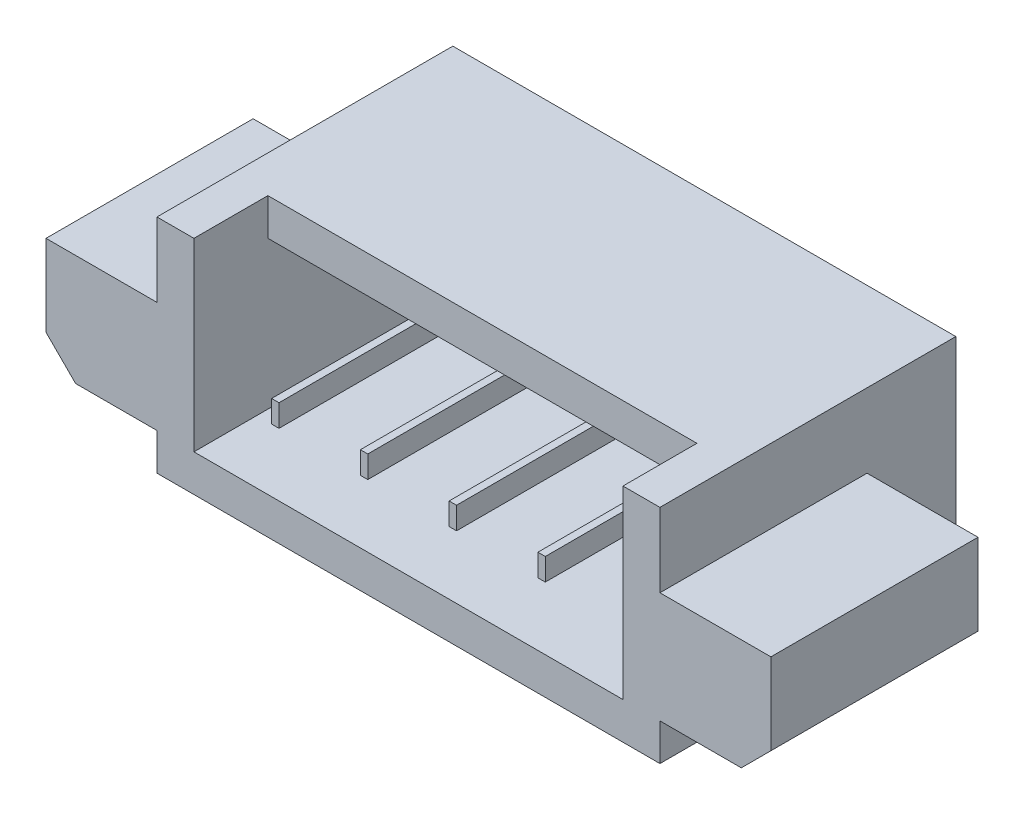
from build123d import *

# Parameters (mm, degrees)
SKETCH_1_W          = 6.8
SKETCH_1_H          = 3
SKETCH_1_W_2        = 5.8
SKETCH_1_H_2        = 2
EXTRUDE_1_DEPTH     = 4
EXTRUDE_2_DEPTH     = 2.8
SKETCH_3_W          = 6.8
SKETCH_3_H          = 3
EXTRUDE_3_DEPTH     = 0.5
SKETCH_5_W          = 5.8
SKETCH_5_H          = 1
CUT_EXTRUDE_1_DEPTH = 0.5
SKETCH_6_W          = 0.1
SKETCH_6_H          = 0.3
EXTRUDE_4_DEPTH     = 3.5


with BuildPart() as part:
    # Sketch 1 → Extrude 1 (new body)
    with BuildSketch(Plane.XY):
        Rectangle(SKETCH_1_W, SKETCH_1_H)
        Rectangle(SKETCH_1_W_2, SKETCH_1_H_2, mode=Mode.SUBTRACT)
    extrude(amount=EXTRUDE_1_DEPTH)

    # Sketch 2 → Extrude 2 (add)
    with BuildSketch(Plane.XY.offset(4)):
        Polygon((-3.4, -1), (-4.5, -1), (-4.9, -0.6), (-4.9, 0.5), (-3.4, 0.5), align=None)
        Polygon((3.4, -1), (3.4, 0.5), (4.9, 0.5), (4.9, -0.6), (4.5, -1), align=None)
    extrude(amount=-EXTRUDE_2_DEPTH)

    # Sketch 3 → Extrude 3 (add)
    with BuildSketch(Plane(origin=(0, 0, 0), x_dir=(-1, 0, 0), z_dir=(0, 0, -1))):
        Rectangle(SKETCH_3_W, SKETCH_3_H)
    extrude(amount=-EXTRUDE_3_DEPTH)

    # Sketch 5 → Cut-Extrude 1 (cut)
    with BuildSketch(Plane(origin=(0, 1.5, 0), x_dir=(1, 0, 0), z_dir=(0, 1, 0))):
        with Locations((0, -3.5)):
            Rectangle(SKETCH_5_W, SKETCH_5_H)
    extrude(amount=-CUT_EXTRUDE_1_DEPTH, mode=Mode.SUBTRACT)

    # Sketch 6 → Extrude 4 (add)
    with BuildSketch(Plane.XY.offset(0.5)):
        with Locations((-0.6, 0)):
            Rectangle(SKETCH_6_W, SKETCH_6_H)
        with Locations((-1.8, 0)):
            Rectangle(SKETCH_6_W, SKETCH_6_H)
        with Locations((0.6, 0)):
            Rectangle(SKETCH_6_W, SKETCH_6_H)
        with Locations((1.8, 0)):
            Rectangle(SKETCH_6_W, SKETCH_6_H)
        with Locations((3, 0)):
            Rectangle(SKETCH_6_W, SKETCH_6_H)
    extrude(amount=EXTRUDE_4_DEPTH)


solid = part.part
